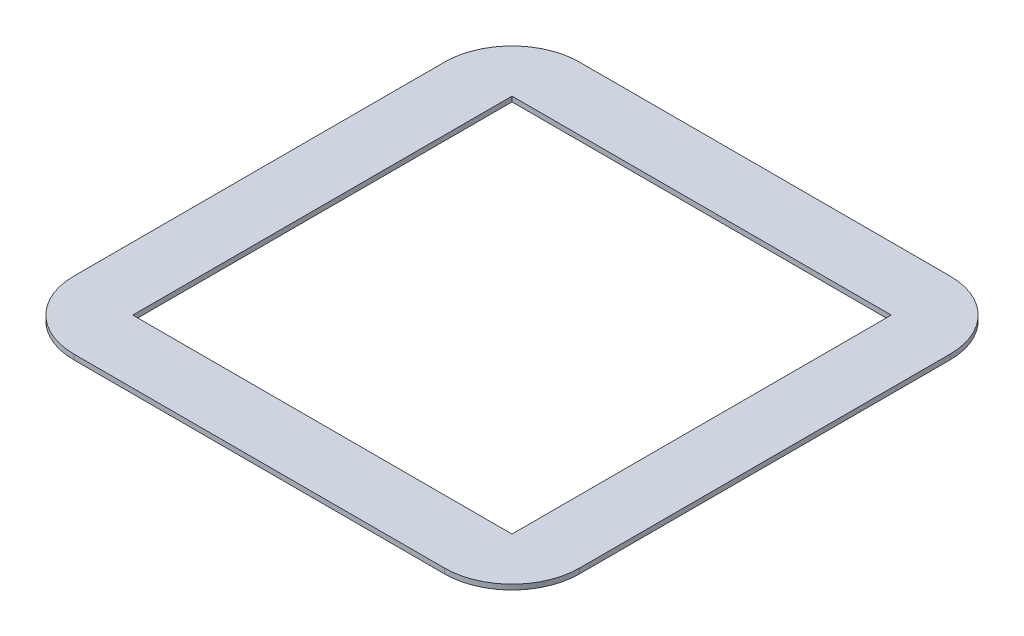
from build123d import *

# Parameters (mm, degrees)
CROQUIS1_W              = 300
CROQUIS1_H              = 300
CROQUIS1_W_2            = 225
CROQUIS1_H_2            = 225
SALIENTE_EXTRUIR1_DEPTH = 3
REDONDEO1_R             = 40


with BuildPart() as part:
    # Croquis1 → Saliente-Extruir1 (new body)
    with BuildSketch(Plane(origin=(0, 0, 0), x_dir=(1, 0, 0), z_dir=(0, 1, 0))):
        Rectangle(CROQUIS1_W, CROQUIS1_H)
        Rectangle(CROQUIS1_W_2, CROQUIS1_H_2, mode=Mode.SUBTRACT)
    extrude(amount=SALIENTE_EXTRUIR1_DEPTH)

    # Redondeo1
    redondeo1_edges = [part.edges().sort_by_distance(p)[0] for p in [
        (150, 1.5, 150),
        (-150, 1.5, 150),
        (-150, 1.5, -150),
        (150, 1.5, -150),
    ]]
    fillet(redondeo1_edges, radius=REDONDEO1_R)


solid = part.part
